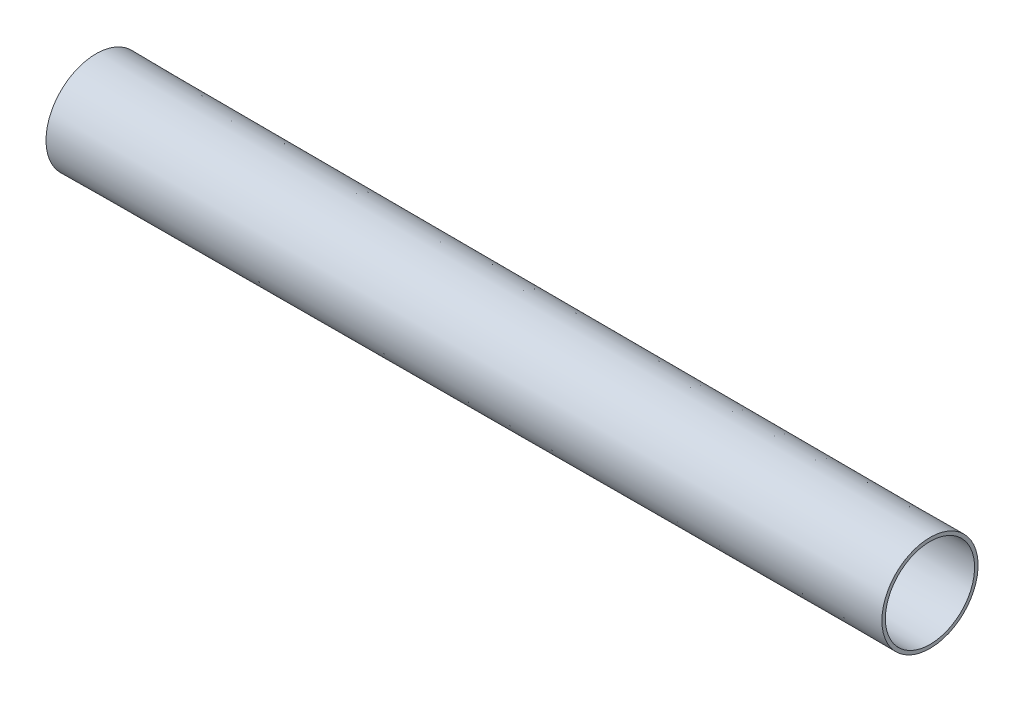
ISO-10303-21;
HEADER;
FILE_DESCRIPTION(('STEP AP214'),'2;1');
FILE_NAME('part.step','',(''),(''),'','','');
FILE_SCHEMA(('AUTOMOTIVE_DESIGN { 1 0 10303 214 1 1 1 1 }'));
ENDSEC;
DATA;
#1=APPLICATION_CONTEXT('core data for automotive mechanical design processes');
#2=APPLICATION_PROTOCOL_DEFINITION('international standard','automotive_design',2000,#1);
#3=PRODUCT_CONTEXT('',#1,'mechanical');
#4=PRODUCT('Part','Part','',(#3));
#5=PRODUCT_RELATED_PRODUCT_CATEGORY('part','',(#4));
#6=PRODUCT_DEFINITION_FORMATION('','',#4);
#7=PRODUCT_DEFINITION_CONTEXT('part definition',#1,'design');
#8=PRODUCT_DEFINITION('design','',#6,#7);
#9=PRODUCT_DEFINITION_SHAPE('','',#8);
#10=(LENGTH_UNIT() NAMED_UNIT(*) SI_UNIT(.MILLI.,.METRE.));
#11=(NAMED_UNIT(*) PLANE_ANGLE_UNIT() SI_UNIT($,.RADIAN.));
#12=(NAMED_UNIT(*) SI_UNIT($,.STERADIAN.) SOLID_ANGLE_UNIT());
#13=UNCERTAINTY_MEASURE_WITH_UNIT(LENGTH_MEASURE(1.E-05),#10,'distance_accuracy_value','');
#14=(GEOMETRIC_REPRESENTATION_CONTEXT(3) GLOBAL_UNCERTAINTY_ASSIGNED_CONTEXT((#13)) GLOBAL_UNIT_ASSIGNED_CONTEXT((#10,
#11,#12)) REPRESENTATION_CONTEXT('',''));
#15=CARTESIAN_POINT('',(0.,0.,0.));
#16=DIRECTION('',(0.,0.,1.));
#17=DIRECTION('',(1.,0.,0.));
#18=AXIS2_PLACEMENT_3D('',#15,#16,#17);
#19=CARTESIAN_POINT('',(34.29,0.,0.));
#20=DIRECTION('',(-1.,0.,0.));
#21=DIRECTION('',(0.,0.,1.));
#22=AXIS2_PLACEMENT_3D('',#19,#20,#21);
#23=CONICAL_SURFACE('',#22,13.4836170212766,0.00238894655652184);
#24=CARTESIAN_POINT('',(275.59,0.,0.));
#25=DIRECTION('',(-1.,0.,0.));
#26=DIRECTION('',(0.,0.,1.));
#27=AXIS2_PLACEMENT_3D('',#24,#25,#26);
#28=CIRCLE('',#27,12.9071631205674);
#29=CARTESIAN_POINT('',(275.59,0.,12.9071631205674));
#30=VERTEX_POINT('',#29);
#31=EDGE_CURVE('E10',#30,#30,#28,.T.);
#32=ORIENTED_EDGE('',*,*,#31,.F.);
#33=EDGE_LOOP('',(#32));
#34=FACE_BOUND('',#33,.T.);
#35=CARTESIAN_POINT('',(34.29,0.,0.));
#36=DIRECTION('',(-1.,0.,0.));
#37=DIRECTION('',(0.,0.,1.));
#38=AXIS2_PLACEMENT_3D('',#35,#36,#37);
#39=CIRCLE('',#38,13.4836170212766);
#40=CARTESIAN_POINT('',(34.29,0.,13.4836170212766));
#41=VERTEX_POINT('',#40);
#42=EDGE_CURVE('E45',#41,#41,#39,.T.);
#43=ORIENTED_EDGE('',*,*,#42,.T.);
#44=EDGE_LOOP('',(#43));
#45=FACE_BOUND('',#44,.T.);
#46=ADVANCED_FACE('F31',(#34,#45),#23,.F.);
#47=CARTESIAN_POINT('',(275.59,12.9071631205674,0.));
#48=DIRECTION('',(-1.,0.,0.));
#49=DIRECTION('',(0.,0.,1.));
#50=AXIS2_PLACEMENT_3D('',#47,#48,#49);
#51=PLANE('',#50);
#52=CARTESIAN_POINT('',(275.59,0.,0.));
#53=DIRECTION('',(-1.,0.,0.));
#54=DIRECTION('',(0.,0.,1.));
#55=AXIS2_PLACEMENT_3D('',#52,#53,#54);
#56=CIRCLE('',#55,13.9159574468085);
#57=CARTESIAN_POINT('',(275.59,0.,13.9159574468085));
#58=VERTEX_POINT('',#57);
#59=EDGE_CURVE('E37',#58,#58,#56,.T.);
#60=ORIENTED_EDGE('',*,*,#59,.F.);
#61=EDGE_LOOP('',(#60));
#62=FACE_BOUND('',#61,.T.);
#63=ORIENTED_EDGE('',*,*,#31,.T.);
#64=EDGE_LOOP('',(#63));
#65=FACE_BOUND('',#64,.T.);
#66=ADVANCED_FACE('F60',(#62,#65),#51,.F.);
#67=CARTESIAN_POINT('',(275.59,0.,0.));
#68=DIRECTION('',(-1.,0.,0.));
#69=DIRECTION('',(0.,0.,1.));
#70=AXIS2_PLACEMENT_3D('',#67,#68,#69);
#71=CONICAL_SURFACE('',#70,13.9159574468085,0.00238894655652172);
#72=CARTESIAN_POINT('',(34.29,0.,0.));
#73=DIRECTION('',(-1.,0.,0.));
#74=DIRECTION('',(0.,0.,1.));
#75=AXIS2_PLACEMENT_3D('',#72,#73,#74);
#76=CIRCLE('',#75,14.4924113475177);
#77=CARTESIAN_POINT('',(34.29,0.,14.4924113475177));
#78=VERTEX_POINT('',#77);
#79=EDGE_CURVE('E41',#78,#78,#76,.T.);
#80=ORIENTED_EDGE('',*,*,#79,.F.);
#81=EDGE_LOOP('',(#80));
#82=FACE_BOUND('',#81,.T.);
#83=ORIENTED_EDGE('',*,*,#59,.T.);
#84=EDGE_LOOP('',(#83));
#85=FACE_BOUND('',#84,.T.);
#86=ADVANCED_FACE('F55',(#82,#85),#71,.T.);
#87=CARTESIAN_POINT('',(34.29,14.4924113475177,0.));
#88=DIRECTION('',(1.,0.,0.));
#89=DIRECTION('',(0.,0.,-1.));
#90=AXIS2_PLACEMENT_3D('',#87,#88,#89);
#91=PLANE('',#90);
#92=ORIENTED_EDGE('',*,*,#42,.F.);
#93=EDGE_LOOP('',(#92));
#94=FACE_BOUND('',#93,.T.);
#95=ORIENTED_EDGE('',*,*,#79,.T.);
#96=EDGE_LOOP('',(#95));
#97=FACE_BOUND('',#96,.T.);
#98=ADVANCED_FACE('F52',(#94,#97),#91,.F.);
#99=CLOSED_SHELL('',(#46,#66,#86,#98));
#100=MANIFOLD_SOLID_BREP('B2',#99);
#101=ADVANCED_BREP_SHAPE_REPRESENTATION('',(#18,#100),#14);
#102=SHAPE_DEFINITION_REPRESENTATION(#9,#101);
ENDSEC;
END-ISO-10303-21;
